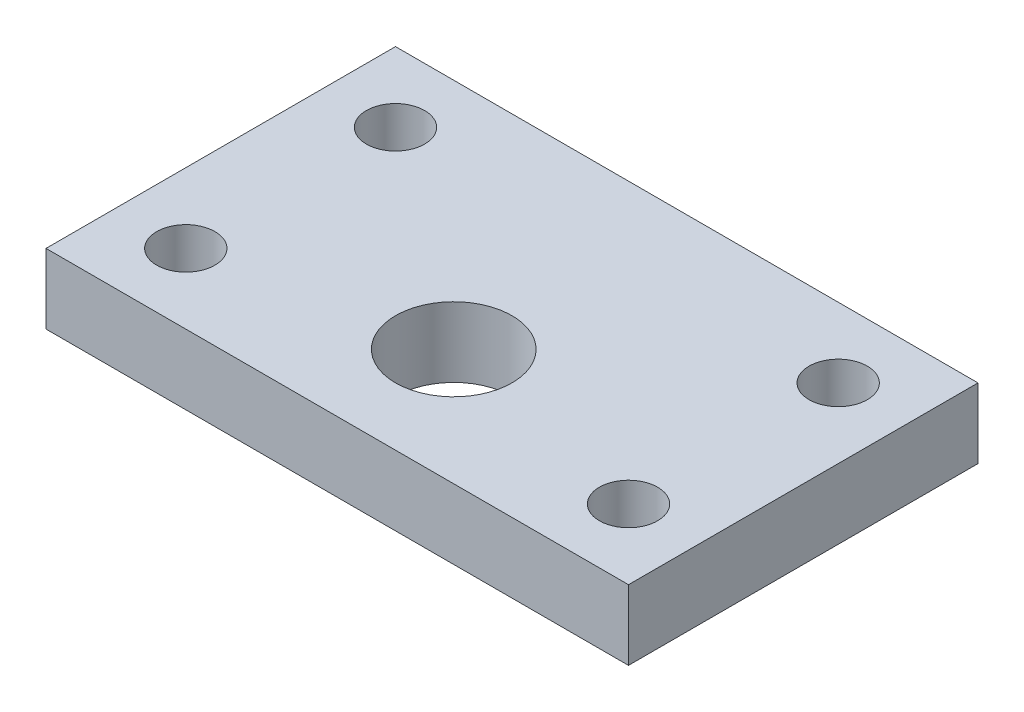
from build123d import *

# Parameters (mm, degrees)
SKETCH1_W           = 250
SKETCH1_H           = 150
BOSS_EXTRUDE1_DEPTH = 30
SKETCH2_R           = 12.5
SKETCH2_R_2         = 25
CUT_EXTRUDE1_DEPTH  = 294.087017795


with BuildPart() as part:
    # Sketch1 → Boss-Extrude1 (new body)
    with BuildSketch(Plane(origin=(0, 0, 0), x_dir=(1, 0, 0), z_dir=(0, 1, 0))):
        with Locations((125, 75)):
            Rectangle(SKETCH1_W, SKETCH1_H)
    extrude(amount=BOSS_EXTRUDE1_DEPTH)

    # Sketch2 → Cut-Extrude1 (cut, through all)
    with BuildSketch(Plane(origin=(0, 30, 0), x_dir=(1, 0, 0), z_dir=(0, 1, 0))):
        with Locations(Location((30, 120, 0), (0, 0, 270))):
            Circle(SKETCH2_R)
        with Locations(Location((220, 120, 0), (0, 0, 270))):
            Circle(SKETCH2_R)
        with Locations(Location((220, 30, 0), (0, 0, 270))):
            Circle(SKETCH2_R)
        with Locations(Location((30, 30, 0), (0, 0, 270))):
            Circle(SKETCH2_R)
        with Locations(Location((125, 50, 0), (0, 0, 270))):
            Circle(SKETCH2_R_2)
    extrude(amount=-CUT_EXTRUDE1_DEPTH, mode=Mode.SUBTRACT)


solid = part.part
